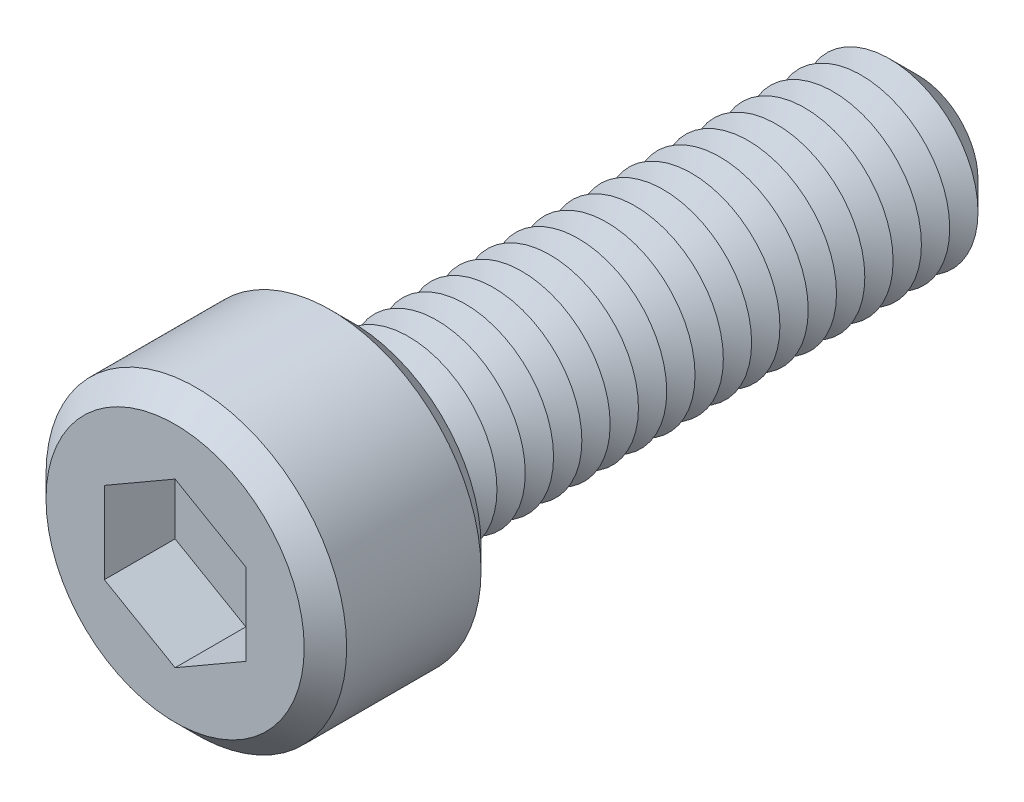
ISO-10303-21;
HEADER;
FILE_DESCRIPTION(('STEP AP214'),'2;1');
FILE_NAME('part.step','',(''),(''),'','','');
FILE_SCHEMA(('AUTOMOTIVE_DESIGN { 1 0 10303 214 1 1 1 1 }'));
ENDSEC;
DATA;
#1=APPLICATION_CONTEXT('core data for automotive mechanical design processes');
#2=APPLICATION_PROTOCOL_DEFINITION('international standard','automotive_design',2000,#1);
#3=PRODUCT_CONTEXT('',#1,'mechanical');
#4=PRODUCT('Part','Part','',(#3));
#5=PRODUCT_RELATED_PRODUCT_CATEGORY('part','',(#4));
#6=PRODUCT_DEFINITION_FORMATION('','',#4);
#7=PRODUCT_DEFINITION_CONTEXT('part definition',#1,'design');
#8=PRODUCT_DEFINITION('design','',#6,#7);
#9=PRODUCT_DEFINITION_SHAPE('','',#8);
#10=(LENGTH_UNIT() NAMED_UNIT(*) SI_UNIT(.MILLI.,.METRE.));
#11=(NAMED_UNIT(*) PLANE_ANGLE_UNIT() SI_UNIT($,.RADIAN.));
#12=(NAMED_UNIT(*) SI_UNIT($,.STERADIAN.) SOLID_ANGLE_UNIT());
#13=UNCERTAINTY_MEASURE_WITH_UNIT(LENGTH_MEASURE(1.E-05),#10,'distance_accuracy_value','');
#14=(GEOMETRIC_REPRESENTATION_CONTEXT(3) GLOBAL_UNCERTAINTY_ASSIGNED_CONTEXT((#13)) GLOBAL_UNIT_ASSIGNED_CONTEXT((#10,
#11,#12)) REPRESENTATION_CONTEXT('',''));
#15=CARTESIAN_POINT('',(0.,0.,0.));
#16=DIRECTION('',(0.,0.,1.));
#17=DIRECTION('',(1.,0.,0.));
#18=AXIS2_PLACEMENT_3D('',#15,#16,#17);
#19=CARTESIAN_POINT('',(0.,0.,5.));
#20=DIRECTION('',(0.,0.,-1.));
#21=DIRECTION('',(-1.,0.,0.));
#22=AXIS2_PLACEMENT_3D('',#19,#20,#21);
#23=CYLINDRICAL_SURFACE('',#22,4.25);
#24=CARTESIAN_POINT('',(0.,0.,0.600000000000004));
#25=DIRECTION('',(0.,0.,1.));
#26=DIRECTION('',(1.,0.,0.));
#27=AXIS2_PLACEMENT_3D('',#24,#25,#26);
#28=CIRCLE('',#27,4.25);
#29=CARTESIAN_POINT('',(4.25,0.,0.600000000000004));
#30=VERTEX_POINT('',#29);
#31=EDGE_CURVE('E328',#30,#30,#28,.T.);
#32=ORIENTED_EDGE('',*,*,#31,.T.);
#33=EDGE_LOOP('',(#32));
#34=FACE_BOUND('',#33,.T.);
#35=CARTESIAN_POINT('',(0.,0.,4.4));
#36=DIRECTION('',(0.,0.,1.));
#37=DIRECTION('',(1.,0.,0.));
#38=AXIS2_PLACEMENT_3D('',#35,#36,#37);
#39=CIRCLE('',#38,4.25);
#40=CARTESIAN_POINT('',(4.25,0.,4.4));
#41=VERTEX_POINT('',#40);
#42=EDGE_CURVE('E324',#41,#41,#39,.F.);
#43=ORIENTED_EDGE('',*,*,#42,.T.);
#44=EDGE_LOOP('',(#43));
#45=FACE_BOUND('',#44,.T.);
#46=ADVANCED_FACE('F39',(#34,#45),#23,.T.);
#47=CARTESIAN_POINT('',(0.,0.,5.));
#48=DIRECTION('',(0.,0.,1.));
#49=DIRECTION('',(1.,0.,0.));
#50=AXIS2_PLACEMENT_3D('',#47,#48,#49);
#51=PLANE('',#50);
#52=CARTESIAN_POINT('',(0.,0.,5.));
#53=DIRECTION('',(0.,0.,1.));
#54=DIRECTION('',(1.,0.,0.));
#55=AXIS2_PLACEMENT_3D('',#52,#53,#54);
#56=CIRCLE('',#55,3.65);
#57=CARTESIAN_POINT('',(3.65,0.,5.));
#58=VERTEX_POINT('',#57);
#59=EDGE_CURVE('E11',#58,#58,#56,.T.);
#60=ORIENTED_EDGE('',*,*,#59,.T.);
#61=EDGE_LOOP('',(#60));
#62=FACE_BOUND('',#61,.T.);
#63=DIRECTION('',(-0.866025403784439,0.5,0.));
#64=VECTOR('',#63,1.);
#65=CARTESIAN_POINT('',(2.,1.15470053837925,5.));
#66=LINE('',#65,#64);
#67=CARTESIAN_POINT('',(2.,1.15470053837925,5.));
#68=VERTEX_POINT('',#67);
#69=CARTESIAN_POINT('',(0.,2.3094010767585,5.));
#70=VERTEX_POINT('',#69);
#71=EDGE_CURVE('E55',#68,#70,#66,.T.);
#72=ORIENTED_EDGE('',*,*,#71,.F.);
#73=DIRECTION('',(0.,1.,0.));
#74=VECTOR('',#73,1.);
#75=CARTESIAN_POINT('',(2.,-1.15470053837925,5.));
#76=LINE('',#75,#74);
#77=CARTESIAN_POINT('',(2.,-1.15470053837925,5.));
#78=VERTEX_POINT('',#77);
#79=EDGE_CURVE('E150',#78,#68,#76,.T.);
#80=ORIENTED_EDGE('',*,*,#79,.F.);
#81=DIRECTION('',(0.866025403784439,0.5,0.));
#82=VECTOR('',#81,1.);
#83=CARTESIAN_POINT('',(0.,-2.3094010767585,5.));
#84=LINE('',#83,#82);
#85=CARTESIAN_POINT('',(0.,-2.3094010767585,5.));
#86=VERTEX_POINT('',#85);
#87=EDGE_CURVE('E148',#86,#78,#84,.T.);
#88=ORIENTED_EDGE('',*,*,#87,.F.);
#89=DIRECTION('',(0.866025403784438,-0.5,0.));
#90=VECTOR('',#89,1.);
#91=CARTESIAN_POINT('',(-2.,-1.15470053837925,5.));
#92=LINE('',#91,#90);
#93=CARTESIAN_POINT('',(-2.,-1.15470053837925,5.));
#94=VERTEX_POINT('',#93);
#95=EDGE_CURVE('E103',#94,#86,#92,.T.);
#96=ORIENTED_EDGE('',*,*,#95,.F.);
#97=DIRECTION('',(0.,-1.,0.));
#98=VECTOR('',#97,1.);
#99=CARTESIAN_POINT('',(-2.,1.15470053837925,5.));
#100=LINE('',#99,#98);
#101=CARTESIAN_POINT('',(-2.,1.15470053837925,5.));
#102=VERTEX_POINT('',#101);
#103=EDGE_CURVE('E142',#102,#94,#100,.T.);
#104=ORIENTED_EDGE('',*,*,#103,.F.);
#105=DIRECTION('',(-0.866025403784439,-0.5,0.));
#106=VECTOR('',#105,1.);
#107=CARTESIAN_POINT('',(0.,2.3094010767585,5.));
#108=LINE('',#107,#106);
#109=EDGE_CURVE('E137',#70,#102,#108,.T.);
#110=ORIENTED_EDGE('',*,*,#109,.F.);
#111=EDGE_LOOP('',(#72,#80,#88,#96,#104,#110));
#112=FACE_BOUND('',#111,.T.);
#113=ADVANCED_FACE('F346',(#62,#112),#51,.T.);
#114=CARTESIAN_POINT('',(0.,0.,0.));
#115=DIRECTION('',(0.,0.,1.));
#116=DIRECTION('',(1.,0.,0.));
#117=AXIS2_PLACEMENT_3D('',#114,#115,#116);
#118=PLANE('',#117);
#119=CARTESIAN_POINT('',(0.,0.,0.));
#120=DIRECTION('',(0.,0.,1.));
#121=DIRECTION('',(1.,0.,0.));
#122=AXIS2_PLACEMENT_3D('',#119,#120,#121);
#123=CIRCLE('',#122,3.65);
#124=CARTESIAN_POINT('',(3.65,0.,0.));
#125=VERTEX_POINT('',#124);
#126=EDGE_CURVE('E48',#125,#125,#123,.F.);
#127=ORIENTED_EDGE('',*,*,#126,.T.);
#128=EDGE_LOOP('',(#127));
#129=FACE_BOUND('',#128,.T.);
#130=CARTESIAN_POINT('',(0.,0.,0.));
#131=DIRECTION('',(0.,0.,1.));
#132=DIRECTION('',(1.,0.,0.));
#133=AXIS2_PLACEMENT_3D('',#130,#131,#132);
#134=CIRCLE('',#133,2.5);
#135=CARTESIAN_POINT('',(2.5,0.,0.));
#136=VERTEX_POINT('',#135);
#137=EDGE_CURVE('E316',#136,#136,#134,.T.);
#138=ORIENTED_EDGE('',*,*,#137,.T.);
#139=EDGE_LOOP('',(#138));
#140=FACE_BOUND('',#139,.T.);
#141=ADVANCED_FACE('F335',(#129,#140),#118,.F.);
#142=CARTESIAN_POINT('',(0.,0.,0.));
#143=DIRECTION('',(0.,0.,1.));
#144=DIRECTION('',(1.,0.,0.));
#145=AXIS2_PLACEMENT_3D('',#142,#143,#144);
#146=CONICAL_SURFACE('',#145,2.5,1.0471975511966);
#147=CARTESIAN_POINT('',(0.,0.,-0.4));
#148=DIRECTION('',(0.,0.,1.));
#149=DIRECTION('',(1.,0.,0.));
#150=AXIS2_PLACEMENT_3D('',#147,#148,#149);
#151=CIRCLE('',#150,1.80717967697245);
#152=CARTESIAN_POINT('',(1.80717967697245,0.,-0.4));
#153=VERTEX_POINT('',#152);
#154=EDGE_CURVE('E312',#153,#153,#151,.T.);
#155=ORIENTED_EDGE('',*,*,#154,.T.);
#156=EDGE_LOOP('',(#155));
#157=FACE_BOUND('',#156,.T.);
#158=ORIENTED_EDGE('',*,*,#137,.F.);
#159=EDGE_LOOP('',(#158));
#160=FACE_BOUND('',#159,.T.);
#161=ADVANCED_FACE('F548',(#157,#160),#146,.T.);
#162=CARTESIAN_POINT('',(0.,0.,-0.4));
#163=DIRECTION('',(0.,0.,-1.));
#164=DIRECTION('',(-1.,0.,0.));
#165=AXIS2_PLACEMENT_3D('',#162,#163,#164);
#166=CONICAL_SURFACE('',#165,1.80717967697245,1.0471975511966);
#167=CARTESIAN_POINT('',(0.,0.,-0.8));
#168=DIRECTION('',(0.,0.,1.));
#169=DIRECTION('',(1.,0.,0.));
#170=AXIS2_PLACEMENT_3D('',#167,#168,#169);
#171=CIRCLE('',#170,2.5);
#172=CARTESIAN_POINT('',(2.5,0.,-0.8));
#173=VERTEX_POINT('',#172);
#174=EDGE_CURVE('E308',#173,#173,#171,.T.);
#175=ORIENTED_EDGE('',*,*,#174,.T.);
#176=EDGE_LOOP('',(#175));
#177=FACE_BOUND('',#176,.T.);
#178=ORIENTED_EDGE('',*,*,#154,.F.);
#179=EDGE_LOOP('',(#178));
#180=FACE_BOUND('',#179,.T.);
#181=ADVANCED_FACE('F544',(#177,#180),#166,.T.);
#182=CARTESIAN_POINT('',(0.,0.,-0.8));
#183=DIRECTION('',(0.,0.,1.));
#184=DIRECTION('',(1.,0.,0.));
#185=AXIS2_PLACEMENT_3D('',#182,#183,#184);
#186=CONICAL_SURFACE('',#185,2.5,1.0471975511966);
#187=CARTESIAN_POINT('',(0.,0.,-1.2));
#188=DIRECTION('',(0.,0.,1.));
#189=DIRECTION('',(1.,0.,0.));
#190=AXIS2_PLACEMENT_3D('',#187,#188,#189);
#191=CIRCLE('',#190,1.80717967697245);
#192=CARTESIAN_POINT('',(1.80717967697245,0.,-1.2));
#193=VERTEX_POINT('',#192);
#194=EDGE_CURVE('E304',#193,#193,#191,.T.);
#195=ORIENTED_EDGE('',*,*,#194,.T.);
#196=EDGE_LOOP('',(#195));
#197=FACE_BOUND('',#196,.T.);
#198=ORIENTED_EDGE('',*,*,#174,.F.);
#199=EDGE_LOOP('',(#198));
#200=FACE_BOUND('',#199,.T.);
#201=ADVANCED_FACE('F540',(#197,#200),#186,.T.);
#202=CARTESIAN_POINT('',(0.,0.,-1.2));
#203=DIRECTION('',(0.,0.,-1.));
#204=DIRECTION('',(-1.,0.,0.));
#205=AXIS2_PLACEMENT_3D('',#202,#203,#204);
#206=CONICAL_SURFACE('',#205,1.80717967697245,1.0471975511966);
#207=CARTESIAN_POINT('',(0.,0.,-1.6));
#208=DIRECTION('',(0.,0.,1.));
#209=DIRECTION('',(1.,0.,0.));
#210=AXIS2_PLACEMENT_3D('',#207,#208,#209);
#211=CIRCLE('',#210,2.5);
#212=CARTESIAN_POINT('',(2.5,0.,-1.6));
#213=VERTEX_POINT('',#212);
#214=EDGE_CURVE('E300',#213,#213,#211,.T.);
#215=ORIENTED_EDGE('',*,*,#214,.T.);
#216=EDGE_LOOP('',(#215));
#217=FACE_BOUND('',#216,.T.);
#218=ORIENTED_EDGE('',*,*,#194,.F.);
#219=EDGE_LOOP('',(#218));
#220=FACE_BOUND('',#219,.T.);
#221=ADVANCED_FACE('F536',(#217,#220),#206,.T.);
#222=CARTESIAN_POINT('',(0.,0.,-1.6));
#223=DIRECTION('',(0.,0.,1.));
#224=DIRECTION('',(1.,0.,0.));
#225=AXIS2_PLACEMENT_3D('',#222,#223,#224);
#226=CONICAL_SURFACE('',#225,2.5,1.0471975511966);
#227=CARTESIAN_POINT('',(0.,0.,-2.));
#228=DIRECTION('',(0.,0.,1.));
#229=DIRECTION('',(1.,0.,0.));
#230=AXIS2_PLACEMENT_3D('',#227,#228,#229);
#231=CIRCLE('',#230,1.80717967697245);
#232=CARTESIAN_POINT('',(1.80717967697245,0.,-2.));
#233=VERTEX_POINT('',#232);
#234=EDGE_CURVE('E296',#233,#233,#231,.T.);
#235=ORIENTED_EDGE('',*,*,#234,.T.);
#236=EDGE_LOOP('',(#235));
#237=FACE_BOUND('',#236,.T.);
#238=ORIENTED_EDGE('',*,*,#214,.F.);
#239=EDGE_LOOP('',(#238));
#240=FACE_BOUND('',#239,.T.);
#241=ADVANCED_FACE('F532',(#237,#240),#226,.T.);
#242=CARTESIAN_POINT('',(0.,0.,-2.));
#243=DIRECTION('',(0.,0.,-1.));
#244=DIRECTION('',(-1.,0.,0.));
#245=AXIS2_PLACEMENT_3D('',#242,#243,#244);
#246=CONICAL_SURFACE('',#245,1.80717967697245,1.0471975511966);
#247=CARTESIAN_POINT('',(0.,0.,-2.4));
#248=DIRECTION('',(0.,0.,1.));
#249=DIRECTION('',(1.,0.,0.));
#250=AXIS2_PLACEMENT_3D('',#247,#248,#249);
#251=CIRCLE('',#250,2.5);
#252=CARTESIAN_POINT('',(2.5,0.,-2.4));
#253=VERTEX_POINT('',#252);
#254=EDGE_CURVE('E292',#253,#253,#251,.T.);
#255=ORIENTED_EDGE('',*,*,#254,.T.);
#256=EDGE_LOOP('',(#255));
#257=FACE_BOUND('',#256,.T.);
#258=ORIENTED_EDGE('',*,*,#234,.F.);
#259=EDGE_LOOP('',(#258));
#260=FACE_BOUND('',#259,.T.);
#261=ADVANCED_FACE('F528',(#257,#260),#246,.T.);
#262=CARTESIAN_POINT('',(0.,0.,-2.4));
#263=DIRECTION('',(0.,0.,1.));
#264=DIRECTION('',(1.,0.,0.));
#265=AXIS2_PLACEMENT_3D('',#262,#263,#264);
#266=CONICAL_SURFACE('',#265,2.5,1.0471975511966);
#267=CARTESIAN_POINT('',(0.,0.,-2.8));
#268=DIRECTION('',(0.,0.,1.));
#269=DIRECTION('',(1.,0.,0.));
#270=AXIS2_PLACEMENT_3D('',#267,#268,#269);
#271=CIRCLE('',#270,1.80717967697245);
#272=CARTESIAN_POINT('',(1.80717967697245,0.,-2.8));
#273=VERTEX_POINT('',#272);
#274=EDGE_CURVE('E288',#273,#273,#271,.T.);
#275=ORIENTED_EDGE('',*,*,#274,.T.);
#276=EDGE_LOOP('',(#275));
#277=FACE_BOUND('',#276,.T.);
#278=ORIENTED_EDGE('',*,*,#254,.F.);
#279=EDGE_LOOP('',(#278));
#280=FACE_BOUND('',#279,.T.);
#281=ADVANCED_FACE('F524',(#277,#280),#266,.T.);
#282=CARTESIAN_POINT('',(0.,0.,-2.8));
#283=DIRECTION('',(0.,0.,-1.));
#284=DIRECTION('',(-1.,0.,0.));
#285=AXIS2_PLACEMENT_3D('',#282,#283,#284);
#286=CONICAL_SURFACE('',#285,1.80717967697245,1.0471975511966);
#287=CARTESIAN_POINT('',(0.,0.,-3.2));
#288=DIRECTION('',(0.,0.,1.));
#289=DIRECTION('',(1.,0.,0.));
#290=AXIS2_PLACEMENT_3D('',#287,#288,#289);
#291=CIRCLE('',#290,2.5);
#292=CARTESIAN_POINT('',(2.5,0.,-3.2));
#293=VERTEX_POINT('',#292);
#294=EDGE_CURVE('E284',#293,#293,#291,.T.);
#295=ORIENTED_EDGE('',*,*,#294,.T.);
#296=EDGE_LOOP('',(#295));
#297=FACE_BOUND('',#296,.T.);
#298=ORIENTED_EDGE('',*,*,#274,.F.);
#299=EDGE_LOOP('',(#298));
#300=FACE_BOUND('',#299,.T.);
#301=ADVANCED_FACE('F520',(#297,#300),#286,.T.);
#302=CARTESIAN_POINT('',(0.,0.,-3.2));
#303=DIRECTION('',(0.,0.,1.));
#304=DIRECTION('',(1.,0.,0.));
#305=AXIS2_PLACEMENT_3D('',#302,#303,#304);
#306=CONICAL_SURFACE('',#305,2.5,1.0471975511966);
#307=CARTESIAN_POINT('',(0.,0.,-3.6));
#308=DIRECTION('',(0.,0.,1.));
#309=DIRECTION('',(1.,0.,0.));
#310=AXIS2_PLACEMENT_3D('',#307,#308,#309);
#311=CIRCLE('',#310,1.80717967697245);
#312=CARTESIAN_POINT('',(1.80717967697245,0.,-3.6));
#313=VERTEX_POINT('',#312);
#314=EDGE_CURVE('E280',#313,#313,#311,.T.);
#315=ORIENTED_EDGE('',*,*,#314,.T.);
#316=EDGE_LOOP('',(#315));
#317=FACE_BOUND('',#316,.T.);
#318=ORIENTED_EDGE('',*,*,#294,.F.);
#319=EDGE_LOOP('',(#318));
#320=FACE_BOUND('',#319,.T.);
#321=ADVANCED_FACE('F516',(#317,#320),#306,.T.);
#322=CARTESIAN_POINT('',(0.,0.,-3.6));
#323=DIRECTION('',(0.,0.,-1.));
#324=DIRECTION('',(-1.,0.,0.));
#325=AXIS2_PLACEMENT_3D('',#322,#323,#324);
#326=CONICAL_SURFACE('',#325,1.80717967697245,1.0471975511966);
#327=CARTESIAN_POINT('',(0.,0.,-4.));
#328=DIRECTION('',(0.,0.,1.));
#329=DIRECTION('',(1.,0.,0.));
#330=AXIS2_PLACEMENT_3D('',#327,#328,#329);
#331=CIRCLE('',#330,2.5);
#332=CARTESIAN_POINT('',(2.5,0.,-4.));
#333=VERTEX_POINT('',#332);
#334=EDGE_CURVE('E276',#333,#333,#331,.T.);
#335=ORIENTED_EDGE('',*,*,#334,.T.);
#336=EDGE_LOOP('',(#335));
#337=FACE_BOUND('',#336,.T.);
#338=ORIENTED_EDGE('',*,*,#314,.F.);
#339=EDGE_LOOP('',(#338));
#340=FACE_BOUND('',#339,.T.);
#341=ADVANCED_FACE('F512',(#337,#340),#326,.T.);
#342=CARTESIAN_POINT('',(0.,0.,-4.));
#343=DIRECTION('',(0.,0.,1.));
#344=DIRECTION('',(1.,0.,0.));
#345=AXIS2_PLACEMENT_3D('',#342,#343,#344);
#346=CONICAL_SURFACE('',#345,2.5,1.0471975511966);
#347=CARTESIAN_POINT('',(0.,0.,-4.4));
#348=DIRECTION('',(0.,0.,1.));
#349=DIRECTION('',(1.,0.,0.));
#350=AXIS2_PLACEMENT_3D('',#347,#348,#349);
#351=CIRCLE('',#350,1.80717967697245);
#352=CARTESIAN_POINT('',(1.80717967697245,0.,-4.4));
#353=VERTEX_POINT('',#352);
#354=EDGE_CURVE('E272',#353,#353,#351,.T.);
#355=ORIENTED_EDGE('',*,*,#354,.T.);
#356=EDGE_LOOP('',(#355));
#357=FACE_BOUND('',#356,.T.);
#358=ORIENTED_EDGE('',*,*,#334,.F.);
#359=EDGE_LOOP('',(#358));
#360=FACE_BOUND('',#359,.T.);
#361=ADVANCED_FACE('F508',(#357,#360),#346,.T.);
#362=CARTESIAN_POINT('',(0.,0.,-4.4));
#363=DIRECTION('',(0.,0.,-1.));
#364=DIRECTION('',(-1.,0.,0.));
#365=AXIS2_PLACEMENT_3D('',#362,#363,#364);
#366=CONICAL_SURFACE('',#365,1.80717967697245,1.0471975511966);
#367=CARTESIAN_POINT('',(0.,0.,-4.8));
#368=DIRECTION('',(0.,0.,1.));
#369=DIRECTION('',(1.,0.,0.));
#370=AXIS2_PLACEMENT_3D('',#367,#368,#369);
#371=CIRCLE('',#370,2.5);
#372=CARTESIAN_POINT('',(2.5,0.,-4.8));
#373=VERTEX_POINT('',#372);
#374=EDGE_CURVE('E268',#373,#373,#371,.T.);
#375=ORIENTED_EDGE('',*,*,#374,.T.);
#376=EDGE_LOOP('',(#375));
#377=FACE_BOUND('',#376,.T.);
#378=ORIENTED_EDGE('',*,*,#354,.F.);
#379=EDGE_LOOP('',(#378));
#380=FACE_BOUND('',#379,.T.);
#381=ADVANCED_FACE('F504',(#377,#380),#366,.T.);
#382=CARTESIAN_POINT('',(0.,0.,-4.8));
#383=DIRECTION('',(0.,0.,1.));
#384=DIRECTION('',(1.,0.,0.));
#385=AXIS2_PLACEMENT_3D('',#382,#383,#384);
#386=CONICAL_SURFACE('',#385,2.5,1.0471975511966);
#387=CARTESIAN_POINT('',(0.,0.,-5.2));
#388=DIRECTION('',(0.,0.,1.));
#389=DIRECTION('',(1.,0.,0.));
#390=AXIS2_PLACEMENT_3D('',#387,#388,#389);
#391=CIRCLE('',#390,1.80717967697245);
#392=CARTESIAN_POINT('',(1.80717967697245,0.,-5.2));
#393=VERTEX_POINT('',#392);
#394=EDGE_CURVE('E264',#393,#393,#391,.T.);
#395=ORIENTED_EDGE('',*,*,#394,.T.);
#396=EDGE_LOOP('',(#395));
#397=FACE_BOUND('',#396,.T.);
#398=ORIENTED_EDGE('',*,*,#374,.F.);
#399=EDGE_LOOP('',(#398));
#400=FACE_BOUND('',#399,.T.);
#401=ADVANCED_FACE('F500',(#397,#400),#386,.T.);
#402=CARTESIAN_POINT('',(0.,0.,-5.2));
#403=DIRECTION('',(0.,0.,-1.));
#404=DIRECTION('',(-1.,0.,0.));
#405=AXIS2_PLACEMENT_3D('',#402,#403,#404);
#406=CONICAL_SURFACE('',#405,1.80717967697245,1.0471975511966);
#407=CARTESIAN_POINT('',(0.,0.,-5.6));
#408=DIRECTION('',(0.,0.,1.));
#409=DIRECTION('',(1.,0.,0.));
#410=AXIS2_PLACEMENT_3D('',#407,#408,#409);
#411=CIRCLE('',#410,2.5);
#412=CARTESIAN_POINT('',(2.5,0.,-5.6));
#413=VERTEX_POINT('',#412);
#414=EDGE_CURVE('E260',#413,#413,#411,.T.);
#415=ORIENTED_EDGE('',*,*,#414,.T.);
#416=EDGE_LOOP('',(#415));
#417=FACE_BOUND('',#416,.T.);
#418=ORIENTED_EDGE('',*,*,#394,.F.);
#419=EDGE_LOOP('',(#418));
#420=FACE_BOUND('',#419,.T.);
#421=ADVANCED_FACE('F496',(#417,#420),#406,.T.);
#422=CARTESIAN_POINT('',(0.,0.,-5.6));
#423=DIRECTION('',(0.,0.,1.));
#424=DIRECTION('',(1.,0.,0.));
#425=AXIS2_PLACEMENT_3D('',#422,#423,#424);
#426=CONICAL_SURFACE('',#425,2.5,1.0471975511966);
#427=CARTESIAN_POINT('',(0.,0.,-6.));
#428=DIRECTION('',(0.,0.,1.));
#429=DIRECTION('',(1.,0.,0.));
#430=AXIS2_PLACEMENT_3D('',#427,#428,#429);
#431=CIRCLE('',#430,1.80717967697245);
#432=CARTESIAN_POINT('',(1.80717967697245,0.,-6.));
#433=VERTEX_POINT('',#432);
#434=EDGE_CURVE('E256',#433,#433,#431,.T.);
#435=ORIENTED_EDGE('',*,*,#434,.T.);
#436=EDGE_LOOP('',(#435));
#437=FACE_BOUND('',#436,.T.);
#438=ORIENTED_EDGE('',*,*,#414,.F.);
#439=EDGE_LOOP('',(#438));
#440=FACE_BOUND('',#439,.T.);
#441=ADVANCED_FACE('F492',(#437,#440),#426,.T.);
#442=CARTESIAN_POINT('',(0.,0.,-6.));
#443=DIRECTION('',(0.,0.,-1.));
#444=DIRECTION('',(-1.,0.,0.));
#445=AXIS2_PLACEMENT_3D('',#442,#443,#444);
#446=CONICAL_SURFACE('',#445,1.80717967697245,1.0471975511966);
#447=CARTESIAN_POINT('',(0.,0.,-6.4));
#448=DIRECTION('',(0.,0.,1.));
#449=DIRECTION('',(1.,0.,0.));
#450=AXIS2_PLACEMENT_3D('',#447,#448,#449);
#451=CIRCLE('',#450,2.5);
#452=CARTESIAN_POINT('',(2.5,0.,-6.4));
#453=VERTEX_POINT('',#452);
#454=EDGE_CURVE('E252',#453,#453,#451,.T.);
#455=ORIENTED_EDGE('',*,*,#454,.T.);
#456=EDGE_LOOP('',(#455));
#457=FACE_BOUND('',#456,.T.);
#458=ORIENTED_EDGE('',*,*,#434,.F.);
#459=EDGE_LOOP('',(#458));
#460=FACE_BOUND('',#459,.T.);
#461=ADVANCED_FACE('F488',(#457,#460),#446,.T.);
#462=CARTESIAN_POINT('',(0.,0.,-6.4));
#463=DIRECTION('',(0.,0.,1.));
#464=DIRECTION('',(1.,0.,0.));
#465=AXIS2_PLACEMENT_3D('',#462,#463,#464);
#466=CONICAL_SURFACE('',#465,2.5,1.0471975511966);
#467=CARTESIAN_POINT('',(0.,0.,-6.8));
#468=DIRECTION('',(0.,0.,1.));
#469=DIRECTION('',(1.,0.,0.));
#470=AXIS2_PLACEMENT_3D('',#467,#468,#469);
#471=CIRCLE('',#470,1.80717967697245);
#472=CARTESIAN_POINT('',(1.80717967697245,0.,-6.8));
#473=VERTEX_POINT('',#472);
#474=EDGE_CURVE('E248',#473,#473,#471,.T.);
#475=ORIENTED_EDGE('',*,*,#474,.T.);
#476=EDGE_LOOP('',(#475));
#477=FACE_BOUND('',#476,.T.);
#478=ORIENTED_EDGE('',*,*,#454,.F.);
#479=EDGE_LOOP('',(#478));
#480=FACE_BOUND('',#479,.T.);
#481=ADVANCED_FACE('F484',(#477,#480),#466,.T.);
#482=CARTESIAN_POINT('',(0.,0.,-6.8));
#483=DIRECTION('',(0.,0.,-1.));
#484=DIRECTION('',(-1.,0.,0.));
#485=AXIS2_PLACEMENT_3D('',#482,#483,#484);
#486=CONICAL_SURFACE('',#485,1.80717967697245,1.0471975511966);
#487=CARTESIAN_POINT('',(0.,0.,-7.2));
#488=DIRECTION('',(0.,0.,1.));
#489=DIRECTION('',(1.,0.,0.));
#490=AXIS2_PLACEMENT_3D('',#487,#488,#489);
#491=CIRCLE('',#490,2.5);
#492=CARTESIAN_POINT('',(2.5,0.,-7.2));
#493=VERTEX_POINT('',#492);
#494=EDGE_CURVE('E244',#493,#493,#491,.T.);
#495=ORIENTED_EDGE('',*,*,#494,.T.);
#496=EDGE_LOOP('',(#495));
#497=FACE_BOUND('',#496,.T.);
#498=ORIENTED_EDGE('',*,*,#474,.F.);
#499=EDGE_LOOP('',(#498));
#500=FACE_BOUND('',#499,.T.);
#501=ADVANCED_FACE('F480',(#497,#500),#486,.T.);
#502=CARTESIAN_POINT('',(0.,0.,-7.2));
#503=DIRECTION('',(0.,0.,1.));
#504=DIRECTION('',(1.,0.,0.));
#505=AXIS2_PLACEMENT_3D('',#502,#503,#504);
#506=CONICAL_SURFACE('',#505,2.5,1.0471975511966);
#507=CARTESIAN_POINT('',(0.,0.,-7.6));
#508=DIRECTION('',(0.,0.,1.));
#509=DIRECTION('',(1.,0.,0.));
#510=AXIS2_PLACEMENT_3D('',#507,#508,#509);
#511=CIRCLE('',#510,1.80717967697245);
#512=CARTESIAN_POINT('',(1.80717967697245,0.,-7.6));
#513=VERTEX_POINT('',#512);
#514=EDGE_CURVE('E240',#513,#513,#511,.T.);
#515=ORIENTED_EDGE('',*,*,#514,.T.);
#516=EDGE_LOOP('',(#515));
#517=FACE_BOUND('',#516,.T.);
#518=ORIENTED_EDGE('',*,*,#494,.F.);
#519=EDGE_LOOP('',(#518));
#520=FACE_BOUND('',#519,.T.);
#521=ADVANCED_FACE('F476',(#517,#520),#506,.T.);
#522=CARTESIAN_POINT('',(0.,0.,-7.6));
#523=DIRECTION('',(0.,0.,-1.));
#524=DIRECTION('',(-1.,0.,0.));
#525=AXIS2_PLACEMENT_3D('',#522,#523,#524);
#526=CONICAL_SURFACE('',#525,1.80717967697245,1.0471975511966);
#527=CARTESIAN_POINT('',(0.,0.,-8.));
#528=DIRECTION('',(0.,0.,1.));
#529=DIRECTION('',(1.,0.,0.));
#530=AXIS2_PLACEMENT_3D('',#527,#528,#529);
#531=CIRCLE('',#530,2.5);
#532=CARTESIAN_POINT('',(2.5,0.,-8.));
#533=VERTEX_POINT('',#532);
#534=EDGE_CURVE('E236',#533,#533,#531,.T.);
#535=ORIENTED_EDGE('',*,*,#534,.T.);
#536=EDGE_LOOP('',(#535));
#537=FACE_BOUND('',#536,.T.);
#538=ORIENTED_EDGE('',*,*,#514,.F.);
#539=EDGE_LOOP('',(#538));
#540=FACE_BOUND('',#539,.T.);
#541=ADVANCED_FACE('F472',(#537,#540),#526,.T.);
#542=CARTESIAN_POINT('',(0.,0.,-8.));
#543=DIRECTION('',(0.,0.,1.));
#544=DIRECTION('',(1.,0.,0.));
#545=AXIS2_PLACEMENT_3D('',#542,#543,#544);
#546=CONICAL_SURFACE('',#545,2.5,1.0471975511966);
#547=CARTESIAN_POINT('',(0.,0.,-8.4));
#548=DIRECTION('',(0.,0.,1.));
#549=DIRECTION('',(1.,0.,0.));
#550=AXIS2_PLACEMENT_3D('',#547,#548,#549);
#551=CIRCLE('',#550,1.80717967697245);
#552=CARTESIAN_POINT('',(1.80717967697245,0.,-8.4));
#553=VERTEX_POINT('',#552);
#554=EDGE_CURVE('E232',#553,#553,#551,.T.);
#555=ORIENTED_EDGE('',*,*,#554,.T.);
#556=EDGE_LOOP('',(#555));
#557=FACE_BOUND('',#556,.T.);
#558=ORIENTED_EDGE('',*,*,#534,.F.);
#559=EDGE_LOOP('',(#558));
#560=FACE_BOUND('',#559,.T.);
#561=ADVANCED_FACE('F468',(#557,#560),#546,.T.);
#562=CARTESIAN_POINT('',(0.,0.,-8.4));
#563=DIRECTION('',(0.,0.,-1.));
#564=DIRECTION('',(-1.,0.,0.));
#565=AXIS2_PLACEMENT_3D('',#562,#563,#564);
#566=CONICAL_SURFACE('',#565,1.80717967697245,1.0471975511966);
#567=CARTESIAN_POINT('',(0.,0.,-8.8));
#568=DIRECTION('',(0.,0.,1.));
#569=DIRECTION('',(1.,0.,0.));
#570=AXIS2_PLACEMENT_3D('',#567,#568,#569);
#571=CIRCLE('',#570,2.5);
#572=CARTESIAN_POINT('',(2.5,0.,-8.8));
#573=VERTEX_POINT('',#572);
#574=EDGE_CURVE('E228',#573,#573,#571,.T.);
#575=ORIENTED_EDGE('',*,*,#574,.T.);
#576=EDGE_LOOP('',(#575));
#577=FACE_BOUND('',#576,.T.);
#578=ORIENTED_EDGE('',*,*,#554,.F.);
#579=EDGE_LOOP('',(#578));
#580=FACE_BOUND('',#579,.T.);
#581=ADVANCED_FACE('F464',(#577,#580),#566,.T.);
#582=CARTESIAN_POINT('',(0.,0.,-8.8));
#583=DIRECTION('',(0.,0.,1.));
#584=DIRECTION('',(1.,0.,0.));
#585=AXIS2_PLACEMENT_3D('',#582,#583,#584);
#586=CONICAL_SURFACE('',#585,2.5,1.0471975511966);
#587=CARTESIAN_POINT('',(0.,0.,-9.2));
#588=DIRECTION('',(0.,0.,1.));
#589=DIRECTION('',(1.,0.,0.));
#590=AXIS2_PLACEMENT_3D('',#587,#588,#589);
#591=CIRCLE('',#590,1.80717967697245);
#592=CARTESIAN_POINT('',(1.80717967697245,0.,-9.2));
#593=VERTEX_POINT('',#592);
#594=EDGE_CURVE('E224',#593,#593,#591,.T.);
#595=ORIENTED_EDGE('',*,*,#594,.T.);
#596=EDGE_LOOP('',(#595));
#597=FACE_BOUND('',#596,.T.);
#598=ORIENTED_EDGE('',*,*,#574,.F.);
#599=EDGE_LOOP('',(#598));
#600=FACE_BOUND('',#599,.T.);
#601=ADVANCED_FACE('F460',(#597,#600),#586,.T.);
#602=CARTESIAN_POINT('',(0.,0.,-9.2));
#603=DIRECTION('',(0.,0.,-1.));
#604=DIRECTION('',(-1.,0.,0.));
#605=AXIS2_PLACEMENT_3D('',#602,#603,#604);
#606=CONICAL_SURFACE('',#605,1.80717967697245,1.0471975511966);
#607=CARTESIAN_POINT('',(0.,0.,-9.6));
#608=DIRECTION('',(0.,0.,1.));
#609=DIRECTION('',(1.,0.,0.));
#610=AXIS2_PLACEMENT_3D('',#607,#608,#609);
#611=CIRCLE('',#610,2.5);
#612=CARTESIAN_POINT('',(2.5,0.,-9.6));
#613=VERTEX_POINT('',#612);
#614=EDGE_CURVE('E220',#613,#613,#611,.T.);
#615=ORIENTED_EDGE('',*,*,#614,.T.);
#616=EDGE_LOOP('',(#615));
#617=FACE_BOUND('',#616,.T.);
#618=ORIENTED_EDGE('',*,*,#594,.F.);
#619=EDGE_LOOP('',(#618));
#620=FACE_BOUND('',#619,.T.);
#621=ADVANCED_FACE('F456',(#617,#620),#606,.T.);
#622=CARTESIAN_POINT('',(0.,0.,-9.6));
#623=DIRECTION('',(0.,0.,1.));
#624=DIRECTION('',(1.,0.,0.));
#625=AXIS2_PLACEMENT_3D('',#622,#623,#624);
#626=CONICAL_SURFACE('',#625,2.5,1.0471975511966);
#627=CARTESIAN_POINT('',(0.,0.,-10.));
#628=DIRECTION('',(0.,0.,1.));
#629=DIRECTION('',(1.,0.,0.));
#630=AXIS2_PLACEMENT_3D('',#627,#628,#629);
#631=CIRCLE('',#630,1.80717967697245);
#632=CARTESIAN_POINT('',(1.80717967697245,0.,-10.));
#633=VERTEX_POINT('',#632);
#634=EDGE_CURVE('E216',#633,#633,#631,.T.);
#635=ORIENTED_EDGE('',*,*,#634,.T.);
#636=EDGE_LOOP('',(#635));
#637=FACE_BOUND('',#636,.T.);
#638=ORIENTED_EDGE('',*,*,#614,.F.);
#639=EDGE_LOOP('',(#638));
#640=FACE_BOUND('',#639,.T.);
#641=ADVANCED_FACE('F452',(#637,#640),#626,.T.);
#642=CARTESIAN_POINT('',(0.,0.,-10.));
#643=DIRECTION('',(0.,0.,-1.));
#644=DIRECTION('',(-1.,0.,0.));
#645=AXIS2_PLACEMENT_3D('',#642,#643,#644);
#646=CONICAL_SURFACE('',#645,1.80717967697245,1.0471975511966);
#647=CARTESIAN_POINT('',(0.,0.,-10.4));
#648=DIRECTION('',(0.,0.,1.));
#649=DIRECTION('',(1.,0.,0.));
#650=AXIS2_PLACEMENT_3D('',#647,#648,#649);
#651=CIRCLE('',#650,2.5);
#652=CARTESIAN_POINT('',(2.5,0.,-10.4));
#653=VERTEX_POINT('',#652);
#654=EDGE_CURVE('E212',#653,#653,#651,.T.);
#655=ORIENTED_EDGE('',*,*,#654,.T.);
#656=EDGE_LOOP('',(#655));
#657=FACE_BOUND('',#656,.T.);
#658=ORIENTED_EDGE('',*,*,#634,.F.);
#659=EDGE_LOOP('',(#658));
#660=FACE_BOUND('',#659,.T.);
#661=ADVANCED_FACE('F448',(#657,#660),#646,.T.);
#662=CARTESIAN_POINT('',(0.,0.,-10.4));
#663=DIRECTION('',(0.,0.,1.));
#664=DIRECTION('',(1.,0.,0.));
#665=AXIS2_PLACEMENT_3D('',#662,#663,#664);
#666=CONICAL_SURFACE('',#665,2.5,1.0471975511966);
#667=CARTESIAN_POINT('',(0.,0.,-10.8));
#668=DIRECTION('',(0.,0.,1.));
#669=DIRECTION('',(1.,0.,0.));
#670=AXIS2_PLACEMENT_3D('',#667,#668,#669);
#671=CIRCLE('',#670,1.80717967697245);
#672=CARTESIAN_POINT('',(1.80717967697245,0.,-10.8));
#673=VERTEX_POINT('',#672);
#674=EDGE_CURVE('E208',#673,#673,#671,.T.);
#675=ORIENTED_EDGE('',*,*,#674,.T.);
#676=EDGE_LOOP('',(#675));
#677=FACE_BOUND('',#676,.T.);
#678=ORIENTED_EDGE('',*,*,#654,.F.);
#679=EDGE_LOOP('',(#678));
#680=FACE_BOUND('',#679,.T.);
#681=ADVANCED_FACE('F444',(#677,#680),#666,.T.);
#682=CARTESIAN_POINT('',(0.,0.,-10.8));
#683=DIRECTION('',(0.,0.,-1.));
#684=DIRECTION('',(-1.,0.,0.));
#685=AXIS2_PLACEMENT_3D('',#682,#683,#684);
#686=CONICAL_SURFACE('',#685,1.80717967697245,1.0471975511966);
#687=CARTESIAN_POINT('',(0.,0.,-11.2));
#688=DIRECTION('',(0.,0.,1.));
#689=DIRECTION('',(1.,0.,0.));
#690=AXIS2_PLACEMENT_3D('',#687,#688,#689);
#691=CIRCLE('',#690,2.5);
#692=CARTESIAN_POINT('',(2.5,0.,-11.2));
#693=VERTEX_POINT('',#692);
#694=EDGE_CURVE('E204',#693,#693,#691,.T.);
#695=ORIENTED_EDGE('',*,*,#694,.T.);
#696=EDGE_LOOP('',(#695));
#697=FACE_BOUND('',#696,.T.);
#698=ORIENTED_EDGE('',*,*,#674,.F.);
#699=EDGE_LOOP('',(#698));
#700=FACE_BOUND('',#699,.T.);
#701=ADVANCED_FACE('F440',(#697,#700),#686,.T.);
#702=CARTESIAN_POINT('',(0.,0.,-11.2));
#703=DIRECTION('',(0.,0.,1.));
#704=DIRECTION('',(1.,0.,0.));
#705=AXIS2_PLACEMENT_3D('',#702,#703,#704);
#706=CONICAL_SURFACE('',#705,2.5,1.0471975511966);
#707=CARTESIAN_POINT('',(0.,0.,-11.6));
#708=DIRECTION('',(0.,0.,1.));
#709=DIRECTION('',(1.,0.,0.));
#710=AXIS2_PLACEMENT_3D('',#707,#708,#709);
#711=CIRCLE('',#710,1.80717967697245);
#712=CARTESIAN_POINT('',(1.80717967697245,0.,-11.6));
#713=VERTEX_POINT('',#712);
#714=EDGE_CURVE('E200',#713,#713,#711,.T.);
#715=ORIENTED_EDGE('',*,*,#714,.T.);
#716=EDGE_LOOP('',(#715));
#717=FACE_BOUND('',#716,.T.);
#718=ORIENTED_EDGE('',*,*,#694,.F.);
#719=EDGE_LOOP('',(#718));
#720=FACE_BOUND('',#719,.T.);
#721=ADVANCED_FACE('F436',(#717,#720),#706,.T.);
#722=CARTESIAN_POINT('',(0.,0.,-11.6));
#723=DIRECTION('',(0.,0.,-1.));
#724=DIRECTION('',(-1.,0.,0.));
#725=AXIS2_PLACEMENT_3D('',#722,#723,#724);
#726=CONICAL_SURFACE('',#725,1.80717967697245,1.0471975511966);
#727=CARTESIAN_POINT('',(0.,0.,-12.));
#728=DIRECTION('',(0.,0.,1.));
#729=DIRECTION('',(1.,0.,0.));
#730=AXIS2_PLACEMENT_3D('',#727,#728,#729);
#731=CIRCLE('',#730,2.5);
#732=CARTESIAN_POINT('',(2.5,0.,-12.));
#733=VERTEX_POINT('',#732);
#734=EDGE_CURVE('E196',#733,#733,#731,.T.);
#735=ORIENTED_EDGE('',*,*,#734,.T.);
#736=EDGE_LOOP('',(#735));
#737=FACE_BOUND('',#736,.T.);
#738=ORIENTED_EDGE('',*,*,#714,.F.);
#739=EDGE_LOOP('',(#738));
#740=FACE_BOUND('',#739,.T.);
#741=ADVANCED_FACE('F432',(#737,#740),#726,.T.);
#742=CARTESIAN_POINT('',(0.,0.,-12.));
#743=DIRECTION('',(0.,0.,1.));
#744=DIRECTION('',(1.,0.,0.));
#745=AXIS2_PLACEMENT_3D('',#742,#743,#744);
#746=CONICAL_SURFACE('',#745,2.5,1.0471975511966);
#747=CARTESIAN_POINT('',(0.,0.,-12.4));
#748=DIRECTION('',(0.,0.,1.));
#749=DIRECTION('',(1.,0.,0.));
#750=AXIS2_PLACEMENT_3D('',#747,#748,#749);
#751=CIRCLE('',#750,1.80717967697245);
#752=CARTESIAN_POINT('',(1.80717967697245,0.,-12.4));
#753=VERTEX_POINT('',#752);
#754=EDGE_CURVE('E192',#753,#753,#751,.T.);
#755=ORIENTED_EDGE('',*,*,#754,.T.);
#756=EDGE_LOOP('',(#755));
#757=FACE_BOUND('',#756,.T.);
#758=ORIENTED_EDGE('',*,*,#734,.F.);
#759=EDGE_LOOP('',(#758));
#760=FACE_BOUND('',#759,.T.);
#761=ADVANCED_FACE('F428',(#757,#760),#746,.T.);
#762=CARTESIAN_POINT('',(0.,0.,-12.4));
#763=DIRECTION('',(0.,0.,-1.));
#764=DIRECTION('',(-1.,0.,0.));
#765=AXIS2_PLACEMENT_3D('',#762,#763,#764);
#766=CONICAL_SURFACE('',#765,1.80717967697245,1.0471975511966);
#767=CARTESIAN_POINT('',(0.,0.,-12.8));
#768=DIRECTION('',(0.,0.,1.));
#769=DIRECTION('',(1.,0.,0.));
#770=AXIS2_PLACEMENT_3D('',#767,#768,#769);
#771=CIRCLE('',#770,2.5);
#772=CARTESIAN_POINT('',(2.5,0.,-12.8));
#773=VERTEX_POINT('',#772);
#774=EDGE_CURVE('E188',#773,#773,#771,.T.);
#775=ORIENTED_EDGE('',*,*,#774,.T.);
#776=EDGE_LOOP('',(#775));
#777=FACE_BOUND('',#776,.T.);
#778=ORIENTED_EDGE('',*,*,#754,.F.);
#779=EDGE_LOOP('',(#778));
#780=FACE_BOUND('',#779,.T.);
#781=ADVANCED_FACE('F424',(#777,#780),#766,.T.);
#782=CARTESIAN_POINT('',(0.,0.,-12.8));
#783=DIRECTION('',(0.,0.,1.));
#784=DIRECTION('',(1.,0.,0.));
#785=AXIS2_PLACEMENT_3D('',#782,#783,#784);
#786=CONICAL_SURFACE('',#785,2.5,1.0471975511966);
#787=CARTESIAN_POINT('',(0.,0.,-13.2));
#788=DIRECTION('',(0.,0.,1.));
#789=DIRECTION('',(1.,0.,0.));
#790=AXIS2_PLACEMENT_3D('',#787,#788,#789);
#791=CIRCLE('',#790,1.80717967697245);
#792=CARTESIAN_POINT('',(1.80717967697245,0.,-13.2));
#793=VERTEX_POINT('',#792);
#794=EDGE_CURVE('E185',#793,#793,#791,.T.);
#795=ORIENTED_EDGE('',*,*,#794,.T.);
#796=EDGE_LOOP('',(#795));
#797=FACE_BOUND('',#796,.T.);
#798=ORIENTED_EDGE('',*,*,#774,.F.);
#799=EDGE_LOOP('',(#798));
#800=FACE_BOUND('',#799,.T.);
#801=ADVANCED_FACE('F420',(#797,#800),#786,.T.);
#802=CARTESIAN_POINT('',(0.,0.,-13.2));
#803=DIRECTION('',(0.,0.,-1.));
#804=DIRECTION('',(-1.,0.,0.));
#805=AXIS2_PLACEMENT_3D('',#802,#803,#804);
#806=CONICAL_SURFACE('',#805,1.80717967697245,1.0471975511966);
#807=CARTESIAN_POINT('',(0.,0.,-13.6));
#808=DIRECTION('',(0.,0.,1.));
#809=DIRECTION('',(1.,0.,0.));
#810=AXIS2_PLACEMENT_3D('',#807,#808,#809);
#811=CIRCLE('',#810,2.5);
#812=CARTESIAN_POINT('',(2.5,0.,-13.6));
#813=VERTEX_POINT('',#812);
#814=EDGE_CURVE('E181',#813,#813,#811,.T.);
#815=ORIENTED_EDGE('',*,*,#814,.T.);
#816=EDGE_LOOP('',(#815));
#817=FACE_BOUND('',#816,.T.);
#818=ORIENTED_EDGE('',*,*,#794,.F.);
#819=EDGE_LOOP('',(#818));
#820=FACE_BOUND('',#819,.T.);
#821=ADVANCED_FACE('F416',(#817,#820),#806,.T.);
#822=CARTESIAN_POINT('',(0.,0.,-13.6));
#823=DIRECTION('',(0.,0.,1.));
#824=DIRECTION('',(1.,0.,0.));
#825=AXIS2_PLACEMENT_3D('',#822,#823,#824);
#826=CONICAL_SURFACE('',#825,2.5,1.0471975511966);
#827=CARTESIAN_POINT('',(0.,0.,-14.));
#828=DIRECTION('',(0.,0.,1.));
#829=DIRECTION('',(1.,0.,0.));
#830=AXIS2_PLACEMENT_3D('',#827,#828,#829);
#831=CIRCLE('',#830,1.80717967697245);
#832=CARTESIAN_POINT('',(1.80717967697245,0.,-14.));
#833=VERTEX_POINT('',#832);
#834=EDGE_CURVE('E177',#833,#833,#831,.T.);
#835=ORIENTED_EDGE('',*,*,#834,.T.);
#836=EDGE_LOOP('',(#835));
#837=FACE_BOUND('',#836,.T.);
#838=ORIENTED_EDGE('',*,*,#814,.F.);
#839=EDGE_LOOP('',(#838));
#840=FACE_BOUND('',#839,.T.);
#841=ADVANCED_FACE('F412',(#837,#840),#826,.T.);
#842=CARTESIAN_POINT('',(0.,0.,-14.));
#843=DIRECTION('',(0.,0.,-1.));
#844=DIRECTION('',(-1.,0.,0.));
#845=AXIS2_PLACEMENT_3D('',#842,#843,#844);
#846=CONICAL_SURFACE('',#845,1.80717967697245,1.0471975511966);
#847=CARTESIAN_POINT('',(0.,0.,-14.4));
#848=DIRECTION('',(0.,0.,1.));
#849=DIRECTION('',(1.,0.,0.));
#850=AXIS2_PLACEMENT_3D('',#847,#848,#849);
#851=CIRCLE('',#850,2.5);
#852=CARTESIAN_POINT('',(2.5,0.,-14.4));
#853=VERTEX_POINT('',#852);
#854=EDGE_CURVE('E173',#853,#853,#851,.T.);
#855=ORIENTED_EDGE('',*,*,#854,.T.);
#856=EDGE_LOOP('',(#855));
#857=FACE_BOUND('',#856,.T.);
#858=ORIENTED_EDGE('',*,*,#834,.F.);
#859=EDGE_LOOP('',(#858));
#860=FACE_BOUND('',#859,.T.);
#861=ADVANCED_FACE('F408',(#857,#860),#846,.T.);
#862=CARTESIAN_POINT('',(0.,0.,-14.4));
#863=DIRECTION('',(0.,0.,1.));
#864=DIRECTION('',(1.,0.,0.));
#865=AXIS2_PLACEMENT_3D('',#862,#863,#864);
#866=CONICAL_SURFACE('',#865,2.5,1.0471975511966);
#867=CARTESIAN_POINT('',(0.,0.,-14.8));
#868=DIRECTION('',(0.,0.,1.));
#869=DIRECTION('',(1.,0.,0.));
#870=AXIS2_PLACEMENT_3D('',#867,#868,#869);
#871=CIRCLE('',#870,1.80717967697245);
#872=CARTESIAN_POINT('',(1.80717967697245,0.,-14.8));
#873=VERTEX_POINT('',#872);
#874=EDGE_CURVE('E169',#873,#873,#871,.T.);
#875=ORIENTED_EDGE('',*,*,#874,.T.);
#876=EDGE_LOOP('',(#875));
#877=FACE_BOUND('',#876,.T.);
#878=ORIENTED_EDGE('',*,*,#854,.F.);
#879=EDGE_LOOP('',(#878));
#880=FACE_BOUND('',#879,.T.);
#881=ADVANCED_FACE('F404',(#877,#880),#866,.T.);
#882=CARTESIAN_POINT('',(0.,0.,-14.8));
#883=DIRECTION('',(0.,0.,-1.));
#884=DIRECTION('',(-1.,0.,0.));
#885=AXIS2_PLACEMENT_3D('',#882,#883,#884);
#886=CONICAL_SURFACE('',#885,1.80717967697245,1.0471975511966);
#887=CARTESIAN_POINT('',(0.,0.,-15.2));
#888=DIRECTION('',(0.,0.,1.));
#889=DIRECTION('',(1.,0.,0.));
#890=AXIS2_PLACEMENT_3D('',#887,#888,#889);
#891=CIRCLE('',#890,2.5);
#892=CARTESIAN_POINT('',(2.5,0.,-15.2));
#893=VERTEX_POINT('',#892);
#894=EDGE_CURVE('E156',#893,#893,#891,.T.);
#895=ORIENTED_EDGE('',*,*,#894,.T.);
#896=EDGE_LOOP('',(#895));
#897=FACE_BOUND('',#896,.T.);
#898=ORIENTED_EDGE('',*,*,#874,.F.);
#899=EDGE_LOOP('',(#898));
#900=FACE_BOUND('',#899,.T.);
#901=ADVANCED_FACE('F400',(#897,#900),#886,.T.);
#902=CARTESIAN_POINT('',(0.,0.,-16.));
#903=DIRECTION('',(0.,0.,-1.));
#904=DIRECTION('',(-1.,0.,0.));
#905=AXIS2_PLACEMENT_3D('',#902,#903,#904);
#906=PLANE('',#905);
#907=CARTESIAN_POINT('',(0.,0.,-16.));
#908=DIRECTION('',(0.,0.,-1.));
#909=DIRECTION('',(-1.,0.,0.));
#910=AXIS2_PLACEMENT_3D('',#907,#908,#909);
#911=CIRCLE('',#910,0.65);
#912=CARTESIAN_POINT('',(-0.65,0.,-16.));
#913=VERTEX_POINT('',#912);
#914=EDGE_CURVE('E138',#913,#913,#911,.F.);
#915=ORIENTED_EDGE('',*,*,#914,.T.);
#916=EDGE_LOOP('',(#915));
#917=FACE_BOUND('',#916,.T.);
#918=CARTESIAN_POINT('',(0.,0.,-16.));
#919=DIRECTION('',(0.,0.,-1.));
#920=DIRECTION('',(-1.,0.,0.));
#921=AXIS2_PLACEMENT_3D('',#918,#919,#920);
#922=CIRCLE('',#921,1.7);
#923=CARTESIAN_POINT('',(-1.7,0.,-16.));
#924=VERTEX_POINT('',#923);
#925=EDGE_CURVE('E320',#924,#924,#922,.T.);
#926=ORIENTED_EDGE('',*,*,#925,.T.);
#927=EDGE_LOOP('',(#926));
#928=FACE_BOUND('',#927,.T.);
#929=ADVANCED_FACE('F403',(#917,#928),#906,.T.);
#930=CARTESIAN_POINT('',(0.,0.,-16.));
#931=DIRECTION('',(0.,0.,1.));
#932=DIRECTION('',(1.,0.,0.));
#933=AXIS2_PLACEMENT_3D('',#930,#931,#932);
#934=CONICAL_SURFACE('',#933,1.7,0.785398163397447);
#935=ORIENTED_EDGE('',*,*,#894,.F.);
#936=EDGE_LOOP('',(#935));
#937=FACE_BOUND('',#936,.T.);
#938=ORIENTED_EDGE('',*,*,#925,.F.);
#939=EDGE_LOOP('',(#938));
#940=FACE_BOUND('',#939,.T.);
#941=ADVANCED_FACE('F399',(#937,#940),#934,.T.);
#942=CARTESIAN_POINT('',(2.,1.15470053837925,3.));
#943=DIRECTION('',(0.5,0.866025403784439,0.));
#944=DIRECTION('',(-0.866025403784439,0.5,0.));
#945=AXIS2_PLACEMENT_3D('',#942,#943,#944);
#946=PLANE('',#945);
#947=ORIENTED_EDGE('',*,*,#71,.T.);
#948=DIRECTION('',(0.,0.,1.));
#949=VECTOR('',#948,1.);
#950=CARTESIAN_POINT('',(0.,2.3094010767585,3.));
#951=LINE('',#950,#949);
#952=CARTESIAN_POINT('',(0.,2.3094010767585,3.));
#953=VERTEX_POINT('',#952);
#954=EDGE_CURVE('E85',#953,#70,#951,.T.);
#955=ORIENTED_EDGE('',*,*,#954,.F.);
#956=DIRECTION('',(-0.866025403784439,0.5,0.));
#957=VECTOR('',#956,1.);
#958=CARTESIAN_POINT('',(2.,1.15470053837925,3.));
#959=LINE('',#958,#957);
#960=CARTESIAN_POINT('',(2.,1.15470053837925,3.));
#961=VERTEX_POINT('',#960);
#962=EDGE_CURVE('E153',#961,#953,#959,.T.);
#963=ORIENTED_EDGE('',*,*,#962,.F.);
#964=DIRECTION('',(0.,0.,1.));
#965=VECTOR('',#964,1.);
#966=CARTESIAN_POINT('',(2.,1.15470053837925,3.));
#967=LINE('',#966,#965);
#968=EDGE_CURVE('E63',#961,#68,#967,.T.);
#969=ORIENTED_EDGE('',*,*,#968,.T.);
#970=EDGE_LOOP('',(#947,#955,#963,#969));
#971=FACE_BOUND('',#970,.T.);
#972=ADVANCED_FACE('F389',(#971),#946,.F.);
#973=CARTESIAN_POINT('',(2.,-1.15470053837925,3.));
#974=DIRECTION('',(1.,0.,0.));
#975=DIRECTION('',(0.,0.,-1.));
#976=AXIS2_PLACEMENT_3D('',#973,#974,#975);
#977=PLANE('',#976);
#978=ORIENTED_EDGE('',*,*,#79,.T.);
#979=ORIENTED_EDGE('',*,*,#968,.F.);
#980=DIRECTION('',(0.,1.,0.));
#981=VECTOR('',#980,1.);
#982=CARTESIAN_POINT('',(2.,-1.15470053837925,3.));
#983=LINE('',#982,#981);
#984=CARTESIAN_POINT('',(2.,-1.15470053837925,3.));
#985=VERTEX_POINT('',#984);
#986=EDGE_CURVE('E117',#985,#961,#983,.T.);
#987=ORIENTED_EDGE('',*,*,#986,.F.);
#988=DIRECTION('',(0.,0.,1.));
#989=VECTOR('',#988,1.);
#990=CARTESIAN_POINT('',(2.,-1.15470053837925,3.));
#991=LINE('',#990,#989);
#992=EDGE_CURVE('E108',#985,#78,#991,.T.);
#993=ORIENTED_EDGE('',*,*,#992,.T.);
#994=EDGE_LOOP('',(#978,#979,#987,#993));
#995=FACE_BOUND('',#994,.T.);
#996=ADVANCED_FACE('F386',(#995),#977,.F.);
#997=CARTESIAN_POINT('',(0.,-2.3094010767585,3.));
#998=DIRECTION('',(0.5,-0.866025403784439,0.));
#999=DIRECTION('',(0.866025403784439,0.5,0.));
#1000=AXIS2_PLACEMENT_3D('',#997,#998,#999);
#1001=PLANE('',#1000);
#1002=ORIENTED_EDGE('',*,*,#87,.T.);
#1003=ORIENTED_EDGE('',*,*,#992,.F.);
#1004=DIRECTION('',(0.866025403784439,0.5,0.));
#1005=VECTOR('',#1004,1.);
#1006=CARTESIAN_POINT('',(0.,-2.3094010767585,3.));
#1007=LINE('',#1006,#1005);
#1008=CARTESIAN_POINT('',(0.,-2.3094010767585,3.));
#1009=VERTEX_POINT('',#1008);
#1010=EDGE_CURVE('E112',#1009,#985,#1007,.T.);
#1011=ORIENTED_EDGE('',*,*,#1010,.F.);
#1012=DIRECTION('',(0.,0.,1.));
#1013=VECTOR('',#1012,1.);
#1014=CARTESIAN_POINT('',(0.,-2.3094010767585,3.));
#1015=LINE('',#1014,#1013);
#1016=EDGE_CURVE('E96',#1009,#86,#1015,.T.);
#1017=ORIENTED_EDGE('',*,*,#1016,.T.);
#1018=EDGE_LOOP('',(#1002,#1003,#1011,#1017));
#1019=FACE_BOUND('',#1018,.T.);
#1020=ADVANCED_FACE('F113',(#1019),#1001,.F.);
#1021=CARTESIAN_POINT('',(-2.,-1.15470053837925,3.));
#1022=DIRECTION('',(-0.5,-0.866025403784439,0.));
#1023=DIRECTION('',(0.866025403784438,-0.5,0.));
#1024=AXIS2_PLACEMENT_3D('',#1021,#1022,#1023);
#1025=PLANE('',#1024);
#1026=ORIENTED_EDGE('',*,*,#95,.T.);
#1027=ORIENTED_EDGE('',*,*,#1016,.F.);
#1028=DIRECTION('',(0.866025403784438,-0.5,0.));
#1029=VECTOR('',#1028,1.);
#1030=CARTESIAN_POINT('',(-2.,-1.15470053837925,3.));
#1031=LINE('',#1030,#1029);
#1032=CARTESIAN_POINT('',(-2.,-1.15470053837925,3.));
#1033=VERTEX_POINT('',#1032);
#1034=EDGE_CURVE('E100',#1033,#1009,#1031,.T.);
#1035=ORIENTED_EDGE('',*,*,#1034,.F.);
#1036=DIRECTION('',(0.,0.,1.));
#1037=VECTOR('',#1036,1.);
#1038=CARTESIAN_POINT('',(-2.,-1.15470053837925,3.));
#1039=LINE('',#1038,#1037);
#1040=EDGE_CURVE('E109',#1033,#94,#1039,.T.);
#1041=ORIENTED_EDGE('',*,*,#1040,.T.);
#1042=EDGE_LOOP('',(#1026,#1027,#1035,#1041));
#1043=FACE_BOUND('',#1042,.T.);
#1044=ADVANCED_FACE('F98',(#1043),#1025,.F.);
#1045=CARTESIAN_POINT('',(-2.,1.15470053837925,3.));
#1046=DIRECTION('',(-1.,0.,0.));
#1047=DIRECTION('',(0.,-1.,0.));
#1048=AXIS2_PLACEMENT_3D('',#1045,#1046,#1047);
#1049=PLANE('',#1048);
#1050=ORIENTED_EDGE('',*,*,#103,.T.);
#1051=ORIENTED_EDGE('',*,*,#1040,.F.);
#1052=DIRECTION('',(0.,-1.,0.));
#1053=VECTOR('',#1052,1.);
#1054=CARTESIAN_POINT('',(-2.,1.15470053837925,3.));
#1055=LINE('',#1054,#1053);
#1056=CARTESIAN_POINT('',(-2.,1.15470053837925,3.));
#1057=VERTEX_POINT('',#1056);
#1058=EDGE_CURVE('E123',#1057,#1033,#1055,.T.);
#1059=ORIENTED_EDGE('',*,*,#1058,.F.);
#1060=DIRECTION('',(0.,0.,1.));
#1061=VECTOR('',#1060,1.);
#1062=CARTESIAN_POINT('',(-2.,1.15470053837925,3.));
#1063=LINE('',#1062,#1061);
#1064=EDGE_CURVE('E161',#1057,#102,#1063,.T.);
#1065=ORIENTED_EDGE('',*,*,#1064,.T.);
#1066=EDGE_LOOP('',(#1050,#1051,#1059,#1065));
#1067=FACE_BOUND('',#1066,.T.);
#1068=ADVANCED_FACE('F383',(#1067),#1049,.F.);
#1069=CARTESIAN_POINT('',(0.,2.3094010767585,3.));
#1070=DIRECTION('',(-0.5,0.866025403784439,0.));
#1071=DIRECTION('',(-0.866025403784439,-0.5,0.));
#1072=AXIS2_PLACEMENT_3D('',#1069,#1070,#1071);
#1073=PLANE('',#1072);
#1074=ORIENTED_EDGE('',*,*,#109,.T.);
#1075=ORIENTED_EDGE('',*,*,#1064,.F.);
#1076=DIRECTION('',(-0.866025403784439,-0.5,0.));
#1077=VECTOR('',#1076,1.);
#1078=CARTESIAN_POINT('',(0.,2.3094010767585,3.));
#1079=LINE('',#1078,#1077);
#1080=EDGE_CURVE('E129',#953,#1057,#1079,.T.);
#1081=ORIENTED_EDGE('',*,*,#1080,.F.);
#1082=ORIENTED_EDGE('',*,*,#954,.T.);
#1083=EDGE_LOOP('',(#1074,#1075,#1081,#1082));
#1084=FACE_BOUND('',#1083,.T.);
#1085=ADVANCED_FACE('F361',(#1084),#1073,.F.);
#1086=CARTESIAN_POINT('',(0.,0.,3.));
#1087=DIRECTION('',(0.,0.,1.));
#1088=DIRECTION('',(1.,0.,0.));
#1089=AXIS2_PLACEMENT_3D('',#1086,#1087,#1088);
#1090=PLANE('',#1089);
#1091=CARTESIAN_POINT('',(0.,0.,3.));
#1092=DIRECTION('',(0.,0.,1.));
#1093=DIRECTION('',(1.,0.,0.));
#1094=AXIS2_PLACEMENT_3D('',#1091,#1092,#1093);
#1095=CIRCLE('',#1094,0.65);
#1096=CARTESIAN_POINT('',(0.65,0.,3.));
#1097=VERTEX_POINT('',#1096);
#1098=EDGE_CURVE('E369',#1097,#1097,#1095,.T.);
#1099=ORIENTED_EDGE('',*,*,#1098,.F.);
#1100=EDGE_LOOP('',(#1099));
#1101=FACE_BOUND('',#1100,.T.);
#1102=ORIENTED_EDGE('',*,*,#962,.T.);
#1103=ORIENTED_EDGE('',*,*,#1080,.T.);
#1104=ORIENTED_EDGE('',*,*,#1058,.T.);
#1105=ORIENTED_EDGE('',*,*,#1034,.T.);
#1106=ORIENTED_EDGE('',*,*,#1010,.T.);
#1107=ORIENTED_EDGE('',*,*,#986,.T.);
#1108=EDGE_LOOP('',(#1102,#1103,#1104,#1105,#1106,#1107));
#1109=FACE_BOUND('',#1108,.T.);
#1110=ADVANCED_FACE('F120',(#1101,#1109),#1090,.T.);
#1111=CARTESIAN_POINT('',(0.,0.,-17.838477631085));
#1112=DIRECTION('',(0.,0.,1.));
#1113=DIRECTION('',(1.,0.,0.));
#1114=AXIS2_PLACEMENT_3D('',#1111,#1112,#1113);
#1115=CYLINDRICAL_SURFACE('',#1114,0.65);
#1116=ORIENTED_EDGE('',*,*,#1098,.T.);
#1117=EDGE_LOOP('',(#1116));
#1118=FACE_BOUND('',#1117,.T.);
#1119=ORIENTED_EDGE('',*,*,#914,.F.);
#1120=EDGE_LOOP('',(#1119));
#1121=FACE_BOUND('',#1120,.T.);
#1122=ADVANCED_FACE('F341',(#1118,#1121),#1115,.F.);
#1123=CARTESIAN_POINT('',(0.,0.,0.600000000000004));
#1124=DIRECTION('',(0.,0.,1.));
#1125=DIRECTION('',(1.,0.,0.));
#1126=AXIS2_PLACEMENT_3D('',#1123,#1124,#1125);
#1127=CONICAL_SURFACE('',#1126,4.25,0.785398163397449);
#1128=ORIENTED_EDGE('',*,*,#126,.F.);
#1129=EDGE_LOOP('',(#1128));
#1130=FACE_BOUND('',#1129,.T.);
#1131=ORIENTED_EDGE('',*,*,#31,.F.);
#1132=EDGE_LOOP('',(#1131));
#1133=FACE_BOUND('',#1132,.T.);
#1134=ADVANCED_FACE('F338',(#1130,#1133),#1127,.T.);
#1135=CARTESIAN_POINT('',(0.,0.,5.));
#1136=DIRECTION('',(0.,0.,-1.));
#1137=DIRECTION('',(-1.,0.,0.));
#1138=AXIS2_PLACEMENT_3D('',#1135,#1136,#1137);
#1139=CONICAL_SURFACE('',#1138,3.65,0.785398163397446);
#1140=ORIENTED_EDGE('',*,*,#42,.F.);
#1141=EDGE_LOOP('',(#1140));
#1142=FACE_BOUND('',#1141,.T.);
#1143=ORIENTED_EDGE('',*,*,#59,.F.);
#1144=EDGE_LOOP('',(#1143));
#1145=FACE_BOUND('',#1144,.T.);
#1146=ADVANCED_FACE('F41',(#1142,#1145),#1139,.T.);
#1147=CLOSED_SHELL('',(#46,#113,#141,#161,#181,#201,#221,#241,#261,#281,#301,#321,#341,#361,
#381,#401,#421,#441,#461,#481,#501,#521,#541,#561,#581,#601,#621,#641,#661,#681,#701,#721,#741,
#761,#781,#801,#821,#841,#861,#881,#901,#929,#941,#972,#996,#1020,#1044,#1068,#1085,#1110,#1122,
#1134,#1146));
#1148=MANIFOLD_SOLID_BREP('B2',#1147);
#1149=ADVANCED_BREP_SHAPE_REPRESENTATION('',(#18,#1148),#14);
#1150=SHAPE_DEFINITION_REPRESENTATION(#9,#1149);
ENDSEC;
END-ISO-10303-21;
